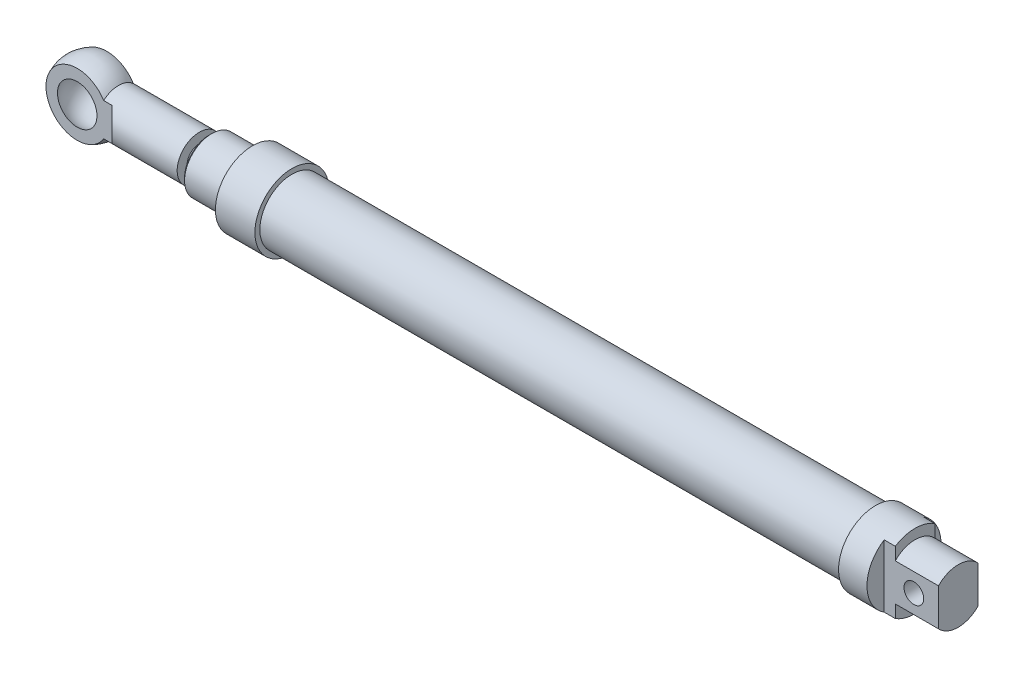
from build123d import *

# Parameters (mm, degrees)
ESQUISSE2_W             = 24.292392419
ESQUISSE2_H             = 10.895930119
ENL_V_MAT_EXTRU_1_DEPTH = 15
ESQUISSE3_R             = 4
ENL_V_MAT_EXTRU_2_DEPTH = 305.739642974
ENL_V_MAT_EXTRU_3_DEPTH = 15
CHANFREIN1_SIZE         = 1


with BuildPart() as part:
    # Esquisse1 → R_volution1 (revolve)
    with BuildSketch(Plane.XY):
        Polygon((0, 5), (0, 11), (17.5, 11), (17.5, 15), (33.5, 15), (33.5, 13), (270, 13), (270, 15), (286, 15), (286, 11), (303.5, 11), (303.5, 0), (-4.5, 0), (-4.5, 5), align=None)
    revolve(axis=Axis((303.5, 0, 0), (-1, 0, 0)))

    # Esquisse2 → Enl_v. mat.-Extru.1 (cut, symmetric)
    with BuildSketch(Plane(origin=(0, 0, 0), x_dir=(1, 0, 0), z_dir=(0, 1, 0))):
        with Locations((293.646196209, 13.44796506)):
            Rectangle(ESQUISSE2_W, ESQUISSE2_H)
        with Locations((293.646196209, -13.44796506)):
            Rectangle(ESQUISSE2_W, ESQUISSE2_H)
    extrude(amount=ENL_V_MAT_EXTRU_1_DEPTH, both=True, mode=Mode.SUBTRACT)

    # Esquisse3 → Enl_v. mat.-Extru.2 (cut, through all)
    with BuildSketch(Plane.XY.offset(8)):
        with Locations((293.5, 0)):
            Circle(ESQUISSE3_R)
    extrude(amount=-ENL_V_MAT_EXTRU_2_DEPTH, mode=Mode.SUBTRACT)

    # Esquisse4 → R_volution3 (revolve)
    with BuildSketch(Plane.XY):
        with BuildLine():
            Line((-36.776194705, 9), (-4, 9))
            Line((-4, 9), (-4, 0))
            Line((-4, 0), (-61.5, 0))
            ThreePointArc((-61.5, 0), (-52.28887909, 13.155479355), (-36.776194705, 9))
        make_face()
    revolve(axis=Axis((-199.414867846, 0, 0), (-1, 0, 0)))

    # Esquisse5 → Enl_v. mat.-Extru.3 (cut, symmetric)
    with BuildSketch(Plane(origin=(0, 0, 0), x_dir=(1, 0, 0), z_dir=(0, 1, 0))):
        Polygon((-277.549493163, 6), (-33.4, 6), (-16.261700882, 23.138299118), (-16.261700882, 78.258202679), (-277.549493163, 16.894663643), align=None)
        Polygon((-277.549493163, -16.894663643), (-277.549493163, -6), (-33.4, -6), (-16.261700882, -23.138299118), (-16.261700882, -78.258202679), align=None)
    extrude(amount=ENL_V_MAT_EXTRU_3_DEPTH, both=True, mode=Mode.SUBTRACT)

    # Esquisse6 → Enl_vement de mati_re-R_volution1 (revolve, cut)
    with BuildSketch(Plane.XY):
        with BuildLine():
            Line((-57.5, 0), (-37.5, 0))
            ThreePointArc((-37.5, 0), (-47.5, 10), (-57.5, 0))
        make_face()
    revolve(axis=Axis((-244.987387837, 0, 0), (-1, 0, 0)), mode=Mode.SUBTRACT)

    # Chanfrein1
    chanfrein1_edges = [part.edges().sort_by_distance(p)[0] for p in [
        (0, -11, 0),
    ]]
    chamfer(chanfrein1_edges, length=CHANFREIN1_SIZE)


solid = part.part
